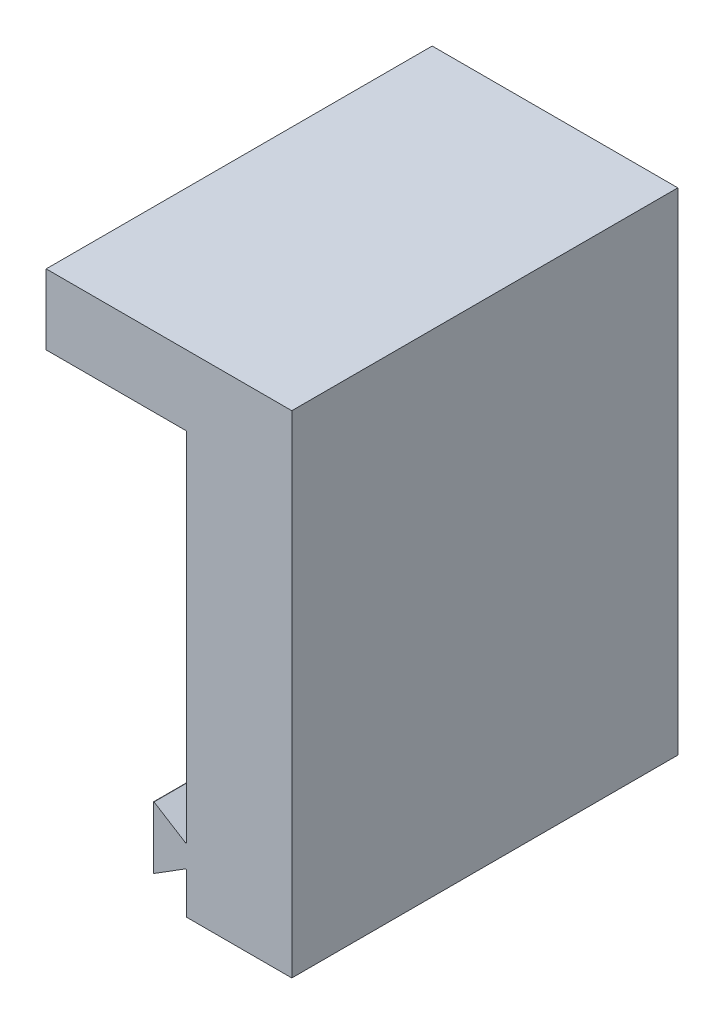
ISO-10303-21;
HEADER;
FILE_DESCRIPTION(('STEP AP214'),'2;1');
FILE_NAME('part.step','',(''),(''),'','','');
FILE_SCHEMA(('AUTOMOTIVE_DESIGN { 1 0 10303 214 1 1 1 1 }'));
ENDSEC;
DATA;
#1=APPLICATION_CONTEXT('core data for automotive mechanical design processes');
#2=APPLICATION_PROTOCOL_DEFINITION('international standard','automotive_design',2000,#1);
#3=PRODUCT_CONTEXT('',#1,'mechanical');
#4=PRODUCT('Part','Part','',(#3));
#5=PRODUCT_RELATED_PRODUCT_CATEGORY('part','',(#4));
#6=PRODUCT_DEFINITION_FORMATION('','',#4);
#7=PRODUCT_DEFINITION_CONTEXT('part definition',#1,'design');
#8=PRODUCT_DEFINITION('design','',#6,#7);
#9=PRODUCT_DEFINITION_SHAPE('','',#8);
#10=(LENGTH_UNIT() NAMED_UNIT(*) SI_UNIT(.MILLI.,.METRE.));
#11=(NAMED_UNIT(*) PLANE_ANGLE_UNIT() SI_UNIT($,.RADIAN.));
#12=(NAMED_UNIT(*) SI_UNIT($,.STERADIAN.) SOLID_ANGLE_UNIT());
#13=UNCERTAINTY_MEASURE_WITH_UNIT(LENGTH_MEASURE(1.E-05),#10,'distance_accuracy_value','');
#14=(GEOMETRIC_REPRESENTATION_CONTEXT(3) GLOBAL_UNCERTAINTY_ASSIGNED_CONTEXT((#13)) GLOBAL_UNIT_ASSIGNED_CONTEXT((#10,
#11,#12)) REPRESENTATION_CONTEXT('',''));
#15=CARTESIAN_POINT('',(0.,0.,0.));
#16=DIRECTION('',(0.,0.,1.));
#17=DIRECTION('',(1.,0.,0.));
#18=AXIS2_PLACEMENT_3D('',#15,#16,#17);
#19=CARTESIAN_POINT('',(0.,-108.241171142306,110.));
#20=DIRECTION('',(0.,1.,0.));
#21=DIRECTION('',(0.,0.,1.));
#22=AXIS2_PLACEMENT_3D('',#19,#20,#21);
#23=PLANE('',#22);
#24=DIRECTION('',(-1.,0.,0.));
#25=VECTOR('',#24,1.);
#26=CARTESIAN_POINT('',(0.,-108.241171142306,35.));
#27=LINE('',#26,#25);
#28=CARTESIAN_POINT('',(0.,-108.241171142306,35.));
#29=VERTEX_POINT('',#28);
#30=CARTESIAN_POINT('',(-0.31795155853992,-108.241171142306,35.));
#31=VERTEX_POINT('',#30);
#32=EDGE_CURVE('E261',#29,#31,#27,.T.);
#33=ORIENTED_EDGE('',*,*,#32,.F.);
#34=DIRECTION('',(0.,0.,-1.));
#35=VECTOR('',#34,1.);
#36=CARTESIAN_POINT('',(0.,-108.241171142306,110.));
#37=LINE('',#36,#35);
#38=CARTESIAN_POINT('',(0.,-108.241171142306,75.));
#39=VERTEX_POINT('',#38);
#40=EDGE_CURVE('E255',#39,#29,#37,.T.);
#41=ORIENTED_EDGE('',*,*,#40,.F.);
#42=DIRECTION('',(1.,0.,0.));
#43=VECTOR('',#42,1.);
#44=CARTESIAN_POINT('',(0.,-108.241171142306,75.));
#45=LINE('',#44,#43);
#46=CARTESIAN_POINT('',(-0.31795155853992,-108.241171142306,75.));
#47=VERTEX_POINT('',#46);
#48=EDGE_CURVE('E236',#47,#39,#45,.T.);
#49=ORIENTED_EDGE('',*,*,#48,.F.);
#50=DIRECTION('',(0.,0.,-1.));
#51=VECTOR('',#50,1.);
#52=CARTESIAN_POINT('',(-0.31795155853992,-108.241171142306,110.));
#53=LINE('',#52,#51);
#54=EDGE_CURVE('E443',#47,#31,#53,.T.);
#55=ORIENTED_EDGE('',*,*,#54,.T.);
#56=EDGE_LOOP('',(#33,#41,#49,#55));
#57=FACE_BOUND('',#56,.T.);
#58=ADVANCED_FACE('F40',(#57),#23,.F.);
#59=DIRECTION('',(1.,0.,0.));
#60=VECTOR('',#59,1.);
#61=CARTESIAN_POINT('',(0.,-108.241171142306,25.));
#62=LINE('',#61,#60);
#63=CARTESIAN_POINT('',(-0.31795155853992,-108.241171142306,25.));
#64=VERTEX_POINT('',#63);
#65=CARTESIAN_POINT('',(0.,-108.241171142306,25.));
#66=VERTEX_POINT('',#65);
#67=EDGE_CURVE('E357',#64,#66,#62,.T.);
#68=ORIENTED_EDGE('',*,*,#67,.F.);
#69=CARTESIAN_POINT('',(-0.31795155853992,-108.241171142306,0.));
#70=VERTEX_POINT('',#69);
#71=EDGE_CURVE('E415',#64,#70,#53,.T.);
#72=ORIENTED_EDGE('',*,*,#71,.T.);
#73=DIRECTION('',(1.,0.,0.));
#74=VECTOR('',#73,1.);
#75=CARTESIAN_POINT('',(0.,-108.241171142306,0.));
#76=LINE('',#75,#74);
#77=CARTESIAN_POINT('',(0.,-108.241171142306,0.));
#78=VERTEX_POINT('',#77);
#79=EDGE_CURVE('E394',#70,#78,#76,.T.);
#80=ORIENTED_EDGE('',*,*,#79,.T.);
#81=EDGE_CURVE('E263',#66,#78,#37,.T.);
#82=ORIENTED_EDGE('',*,*,#81,.F.);
#83=EDGE_LOOP('',(#68,#72,#80,#82));
#84=FACE_BOUND('',#83,.T.);
#85=ADVANCED_FACE('F574',(#84),#23,.F.);
#86=DIRECTION('',(-1.,0.,0.));
#87=VECTOR('',#86,1.);
#88=CARTESIAN_POINT('',(0.,-108.241171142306,85.));
#89=LINE('',#88,#87);
#90=CARTESIAN_POINT('',(0.,-108.241171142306,85.));
#91=VERTEX_POINT('',#90);
#92=CARTESIAN_POINT('',(-0.31795155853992,-108.241171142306,85.));
#93=VERTEX_POINT('',#92);
#94=EDGE_CURVE('E343',#91,#93,#89,.T.);
#95=ORIENTED_EDGE('',*,*,#94,.F.);
#96=CARTESIAN_POINT('',(0.,-108.241171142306,110.));
#97=VERTEX_POINT('',#96);
#98=EDGE_CURVE('E262',#97,#91,#37,.T.);
#99=ORIENTED_EDGE('',*,*,#98,.F.);
#100=DIRECTION('',(1.,0.,0.));
#101=VECTOR('',#100,1.);
#102=CARTESIAN_POINT('',(0.,-108.241171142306,110.));
#103=LINE('',#102,#101);
#104=CARTESIAN_POINT('',(-0.31795155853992,-108.241171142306,110.));
#105=VERTEX_POINT('',#104);
#106=EDGE_CURVE('E395',#105,#97,#103,.T.);
#107=ORIENTED_EDGE('',*,*,#106,.F.);
#108=EDGE_CURVE('E439',#105,#93,#53,.T.);
#109=ORIENTED_EDGE('',*,*,#108,.T.);
#110=EDGE_LOOP('',(#95,#99,#107,#109));
#111=FACE_BOUND('',#110,.T.);
#112=ADVANCED_FACE('F485',(#111),#23,.F.);
#113=CARTESIAN_POINT('',(0.,-101.758828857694,110.));
#114=DIRECTION('',(0.,-1.,0.));
#115=DIRECTION('',(0.,0.,-1.));
#116=AXIS2_PLACEMENT_3D('',#113,#114,#115);
#117=PLANE('',#116);
#118=DIRECTION('',(1.,0.,0.));
#119=VECTOR('',#118,1.);
#120=CARTESIAN_POINT('',(0.,-101.758828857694,35.));
#121=LINE('',#120,#119);
#122=CARTESIAN_POINT('',(-0.317951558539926,-101.758828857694,35.));
#123=VERTEX_POINT('',#122);
#124=CARTESIAN_POINT('',(0.,-101.758828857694,35.));
#125=VERTEX_POINT('',#124);
#126=EDGE_CURVE('E363',#123,#125,#121,.T.);
#127=ORIENTED_EDGE('',*,*,#126,.F.);
#128=DIRECTION('',(0.,0.,-1.));
#129=VECTOR('',#128,1.);
#130=CARTESIAN_POINT('',(-0.317951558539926,-101.758828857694,110.));
#131=LINE('',#130,#129);
#132=CARTESIAN_POINT('',(-0.317951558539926,-101.758828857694,75.));
#133=VERTEX_POINT('',#132);
#134=EDGE_CURVE('E448',#133,#123,#131,.T.);
#135=ORIENTED_EDGE('',*,*,#134,.F.);
#136=DIRECTION('',(-1.,0.,0.));
#137=VECTOR('',#136,1.);
#138=CARTESIAN_POINT('',(0.,-101.758828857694,75.));
#139=LINE('',#138,#137);
#140=CARTESIAN_POINT('',(0.,-101.758828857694,75.));
#141=VERTEX_POINT('',#140);
#142=EDGE_CURVE('E324',#141,#133,#139,.T.);
#143=ORIENTED_EDGE('',*,*,#142,.F.);
#144=DIRECTION('',(0.,0.,-1.));
#145=VECTOR('',#144,1.);
#146=CARTESIAN_POINT('',(0.,-101.758828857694,110.));
#147=LINE('',#146,#145);
#148=EDGE_CURVE('E257',#141,#125,#147,.T.);
#149=ORIENTED_EDGE('',*,*,#148,.T.);
#150=EDGE_LOOP('',(#127,#135,#143,#149));
#151=FACE_BOUND('',#150,.T.);
#152=ADVANCED_FACE('F524',(#151),#117,.F.);
#153=DIRECTION('',(-1.,0.,0.));
#154=VECTOR('',#153,1.);
#155=CARTESIAN_POINT('',(0.,-101.758828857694,25.));
#156=LINE('',#155,#154);
#157=CARTESIAN_POINT('',(0.,-101.758828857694,25.));
#158=VERTEX_POINT('',#157);
#159=CARTESIAN_POINT('',(-0.317951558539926,-101.758828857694,25.));
#160=VERTEX_POINT('',#159);
#161=EDGE_CURVE('E350',#158,#160,#156,.T.);
#162=ORIENTED_EDGE('',*,*,#161,.F.);
#163=CARTESIAN_POINT('',(0.,-101.758828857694,0.));
#164=VERTEX_POINT('',#163);
#165=EDGE_CURVE('E447',#158,#164,#147,.T.);
#166=ORIENTED_EDGE('',*,*,#165,.T.);
#167=DIRECTION('',(-1.,0.,0.));
#168=VECTOR('',#167,1.);
#169=CARTESIAN_POINT('',(0.,-101.758828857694,0.));
#170=LINE('',#169,#168);
#171=CARTESIAN_POINT('',(-0.317951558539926,-101.758828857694,0.));
#172=VERTEX_POINT('',#171);
#173=EDGE_CURVE('E428',#164,#172,#170,.T.);
#174=ORIENTED_EDGE('',*,*,#173,.T.);
#175=EDGE_CURVE('E442',#160,#172,#131,.T.);
#176=ORIENTED_EDGE('',*,*,#175,.F.);
#177=EDGE_LOOP('',(#162,#166,#174,#176));
#178=FACE_BOUND('',#177,.T.);
#179=ADVANCED_FACE('F529',(#178),#117,.F.);
#180=DIRECTION('',(1.,0.,0.));
#181=VECTOR('',#180,1.);
#182=CARTESIAN_POINT('',(0.,-101.758828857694,85.));
#183=LINE('',#182,#181);
#184=CARTESIAN_POINT('',(-0.317951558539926,-101.758828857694,85.));
#185=VERTEX_POINT('',#184);
#186=CARTESIAN_POINT('',(0.,-101.758828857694,85.));
#187=VERTEX_POINT('',#186);
#188=EDGE_CURVE('E336',#185,#187,#183,.T.);
#189=ORIENTED_EDGE('',*,*,#188,.F.);
#190=CARTESIAN_POINT('',(-0.317951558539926,-101.758828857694,110.));
#191=VERTEX_POINT('',#190);
#192=EDGE_CURVE('E444',#191,#185,#131,.T.);
#193=ORIENTED_EDGE('',*,*,#192,.F.);
#194=DIRECTION('',(-1.,0.,0.));
#195=VECTOR('',#194,1.);
#196=CARTESIAN_POINT('',(0.,-101.758828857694,110.));
#197=LINE('',#196,#195);
#198=CARTESIAN_POINT('',(0.,-101.758828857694,110.));
#199=VERTEX_POINT('',#198);
#200=EDGE_CURVE('E407',#199,#191,#197,.T.);
#201=ORIENTED_EDGE('',*,*,#200,.F.);
#202=EDGE_CURVE('E449',#199,#187,#147,.T.);
#203=ORIENTED_EDGE('',*,*,#202,.T.);
#204=EDGE_LOOP('',(#189,#193,#201,#203));
#205=FACE_BOUND('',#204,.T.);
#206=ADVANCED_FACE('F509',(#205),#117,.F.);
#207=CARTESIAN_POINT('',(-45.8194001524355,-73.3263681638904,110.));
#208=DIRECTION('',(-0.52991926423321,-0.848048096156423,0.));
#209=DIRECTION('',(0.848048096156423,-0.52991926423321,0.));
#210=AXIS2_PLACEMENT_3D('',#207,#208,#209);
#211=PLANE('',#210);
#212=DIRECTION('',(0.848048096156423,-0.52991926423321,0.));
#213=VECTOR('',#212,1.);
#214=CARTESIAN_POINT('',(-45.8194001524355,-73.3263681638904,35.));
#215=LINE('',#214,#213);
#216=CARTESIAN_POINT('',(-9.24909888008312,-96.1780286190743,35.));
#217=VERTEX_POINT('',#216);
#218=EDGE_CURVE('E307',#217,#123,#215,.T.);
#219=ORIENTED_EDGE('',*,*,#218,.F.);
#220=DIRECTION('',(0.,0.,-1.));
#221=VECTOR('',#220,1.);
#222=CARTESIAN_POINT('',(-9.24909888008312,-96.1780286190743,110.));
#223=LINE('',#222,#221);
#224=CARTESIAN_POINT('',(-9.24909888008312,-96.1780286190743,75.));
#225=VERTEX_POINT('',#224);
#226=EDGE_CURVE('E48',#217,#225,#223,.F.);
#227=ORIENTED_EDGE('',*,*,#226,.T.);
#228=DIRECTION('',(-0.848048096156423,0.52991926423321,0.));
#229=VECTOR('',#228,1.);
#230=CARTESIAN_POINT('',(-45.8194001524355,-73.3263681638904,75.));
#231=LINE('',#230,#229);
#232=EDGE_CURVE('E56',#133,#225,#231,.T.);
#233=ORIENTED_EDGE('',*,*,#232,.F.);
#234=ORIENTED_EDGE('',*,*,#134,.T.);
#235=EDGE_LOOP('',(#219,#227,#233,#234));
#236=FACE_BOUND('',#235,.T.);
#237=ADVANCED_FACE('F304',(#236),#211,.F.);
#238=DIRECTION('',(-0.848048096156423,0.52991926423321,0.));
#239=VECTOR('',#238,1.);
#240=CARTESIAN_POINT('',(-45.8194001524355,-73.3263681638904,25.));
#241=LINE('',#240,#239);
#242=CARTESIAN_POINT('',(-9.24909888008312,-96.1780286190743,25.));
#243=VERTEX_POINT('',#242);
#244=EDGE_CURVE('E64',#160,#243,#241,.T.);
#245=ORIENTED_EDGE('',*,*,#244,.F.);
#246=ORIENTED_EDGE('',*,*,#175,.T.);
#247=DIRECTION('',(-0.848048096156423,0.52991926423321,0.));
#248=VECTOR('',#247,1.);
#249=CARTESIAN_POINT('',(-45.8194001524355,-73.3263681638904,0.));
#250=LINE('',#249,#248);
#251=CARTESIAN_POINT('',(-9.24909888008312,-96.1780286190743,0.));
#252=VERTEX_POINT('',#251);
#253=EDGE_CURVE('E431',#172,#252,#250,.T.);
#254=ORIENTED_EDGE('',*,*,#253,.T.);
#255=EDGE_CURVE('E11',#252,#243,#223,.F.);
#256=ORIENTED_EDGE('',*,*,#255,.T.);
#257=EDGE_LOOP('',(#245,#246,#254,#256));
#258=FACE_BOUND('',#257,.T.);
#259=ADVANCED_FACE('F527',(#258),#211,.F.);
#260=DIRECTION('',(0.848048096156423,-0.52991926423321,0.));
#261=VECTOR('',#260,1.);
#262=CARTESIAN_POINT('',(-45.8194001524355,-73.3263681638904,85.));
#263=LINE('',#262,#261);
#264=CARTESIAN_POINT('',(-9.24909888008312,-96.1780286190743,85.));
#265=VERTEX_POINT('',#264);
#266=EDGE_CURVE('E334',#265,#185,#263,.T.);
#267=ORIENTED_EDGE('',*,*,#266,.F.);
#268=CARTESIAN_POINT('',(-9.24909888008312,-96.1780286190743,110.));
#269=VERTEX_POINT('',#268);
#270=EDGE_CURVE('E49',#265,#269,#223,.F.);
#271=ORIENTED_EDGE('',*,*,#270,.T.);
#272=DIRECTION('',(-0.848048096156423,0.52991926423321,0.));
#273=VECTOR('',#272,1.);
#274=CARTESIAN_POINT('',(-45.8194001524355,-73.3263681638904,110.));
#275=LINE('',#274,#273);
#276=EDGE_CURVE('E409',#191,#269,#275,.T.);
#277=ORIENTED_EDGE('',*,*,#276,.F.);
#278=ORIENTED_EDGE('',*,*,#192,.T.);
#279=EDGE_LOOP('',(#267,#271,#277,#278));
#280=FACE_BOUND('',#279,.T.);
#281=ADVANCED_FACE('F505',(#280),#211,.F.);
#282=CARTESIAN_POINT('',(-9.40209080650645,0.,110.));
#283=DIRECTION('',(1.,0.,0.));
#284=DIRECTION('',(0.,0.,-1.));
#285=AXIS2_PLACEMENT_3D('',#282,#283,#284);
#286=PLANE('',#285);
#287=DIRECTION('',(0.,1.,0.));
#288=VECTOR('',#287,1.);
#289=CARTESIAN_POINT('',(-9.40209080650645,0.,35.));
#290=LINE('',#289,#288);
#291=CARTESIAN_POINT('',(-9.40209080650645,-113.73716657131,35.));
#292=VERTEX_POINT('',#291);
#293=CARTESIAN_POINT('',(-9.40209080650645,-96.26283342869,35.));
#294=VERTEX_POINT('',#293);
#295=EDGE_CURVE('E360',#292,#294,#290,.T.);
#296=ORIENTED_EDGE('',*,*,#295,.F.);
#297=DIRECTION('',(0.,0.,-1.));
#298=VECTOR('',#297,1.);
#299=CARTESIAN_POINT('',(-9.40209080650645,-113.73716657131,110.));
#300=LINE('',#299,#298);
#301=CARTESIAN_POINT('',(-9.40209080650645,-113.73716657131,75.));
#302=VERTEX_POINT('',#301);
#303=EDGE_CURVE('E289',#292,#302,#300,.F.);
#304=ORIENTED_EDGE('',*,*,#303,.T.);
#305=DIRECTION('',(0.,-1.,0.));
#306=VECTOR('',#305,1.);
#307=CARTESIAN_POINT('',(-9.40209080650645,0.,75.));
#308=LINE('',#307,#306);
#309=CARTESIAN_POINT('',(-9.40209080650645,-96.26283342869,75.));
#310=VERTEX_POINT('',#309);
#311=EDGE_CURVE('E315',#310,#302,#308,.T.);
#312=ORIENTED_EDGE('',*,*,#311,.F.);
#313=DIRECTION('',(0.,0.,-1.));
#314=VECTOR('',#313,1.);
#315=CARTESIAN_POINT('',(-9.40209080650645,-96.26283342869,110.));
#316=LINE('',#315,#314);
#317=EDGE_CURVE('E284',#310,#294,#316,.T.);
#318=ORIENTED_EDGE('',*,*,#317,.T.);
#319=EDGE_LOOP('',(#296,#304,#312,#318));
#320=FACE_BOUND('',#319,.T.);
#321=ADVANCED_FACE('F563',(#320),#286,.F.);
#322=DIRECTION('',(0.,-1.,0.));
#323=VECTOR('',#322,1.);
#324=CARTESIAN_POINT('',(-9.40209080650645,0.,25.));
#325=LINE('',#324,#323);
#326=CARTESIAN_POINT('',(-9.40209080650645,-96.26283342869,25.));
#327=VERTEX_POINT('',#326);
#328=CARTESIAN_POINT('',(-9.40209080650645,-113.73716657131,25.));
#329=VERTEX_POINT('',#328);
#330=EDGE_CURVE('E347',#327,#329,#325,.T.);
#331=ORIENTED_EDGE('',*,*,#330,.F.);
#332=CARTESIAN_POINT('',(-9.40209080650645,-96.26283342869,0.));
#333=VERTEX_POINT('',#332);
#334=EDGE_CURVE('E279',#327,#333,#316,.T.);
#335=ORIENTED_EDGE('',*,*,#334,.T.);
#336=DIRECTION('',(0.,-1.,0.));
#337=VECTOR('',#336,1.);
#338=CARTESIAN_POINT('',(-9.40209080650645,0.,0.));
#339=LINE('',#338,#337);
#340=CARTESIAN_POINT('',(-9.40209080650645,-113.73716657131,0.));
#341=VERTEX_POINT('',#340);
#342=EDGE_CURVE('E434',#333,#341,#339,.T.);
#343=ORIENTED_EDGE('',*,*,#342,.T.);
#344=EDGE_CURVE('E285',#341,#329,#300,.F.);
#345=ORIENTED_EDGE('',*,*,#344,.T.);
#346=EDGE_LOOP('',(#331,#335,#343,#345));
#347=FACE_BOUND('',#346,.T.);
#348=ADVANCED_FACE('F538',(#347),#286,.F.);
#349=DIRECTION('',(0.,1.,0.));
#350=VECTOR('',#349,1.);
#351=CARTESIAN_POINT('',(-9.40209080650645,0.,85.));
#352=LINE('',#351,#350);
#353=CARTESIAN_POINT('',(-9.40209080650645,-113.73716657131,85.));
#354=VERTEX_POINT('',#353);
#355=CARTESIAN_POINT('',(-9.40209080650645,-96.26283342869,85.));
#356=VERTEX_POINT('',#355);
#357=EDGE_CURVE('E332',#354,#356,#352,.T.);
#358=ORIENTED_EDGE('',*,*,#357,.F.);
#359=CARTESIAN_POINT('',(-9.40209080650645,-113.73716657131,110.));
#360=VERTEX_POINT('',#359);
#361=EDGE_CURVE('E283',#354,#360,#300,.F.);
#362=ORIENTED_EDGE('',*,*,#361,.T.);
#363=DIRECTION('',(0.,-1.,0.));
#364=VECTOR('',#363,1.);
#365=CARTESIAN_POINT('',(-9.40209080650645,0.,110.));
#366=LINE('',#365,#364);
#367=CARTESIAN_POINT('',(-9.40209080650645,-96.26283342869,110.));
#368=VERTEX_POINT('',#367);
#369=EDGE_CURVE('E411',#368,#360,#366,.T.);
#370=ORIENTED_EDGE('',*,*,#369,.F.);
#371=EDGE_CURVE('E280',#368,#356,#316,.T.);
#372=ORIENTED_EDGE('',*,*,#371,.T.);
#373=EDGE_LOOP('',(#358,#362,#370,#372));
#374=FACE_BOUND('',#373,.T.);
#375=ADVANCED_FACE('F498',(#374),#286,.F.);
#376=CARTESIAN_POINT('',(48.5539747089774,-77.7026022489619,110.));
#377=DIRECTION('',(-0.529919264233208,0.848048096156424,0.));
#378=DIRECTION('',(-0.848048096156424,-0.529919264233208,0.));
#379=AXIS2_PLACEMENT_3D('',#376,#377,#378);
#380=PLANE('',#379);
#381=DIRECTION('',(-0.848048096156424,-0.529919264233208,0.));
#382=VECTOR('',#381,1.);
#383=CARTESIAN_POINT('',(48.5539747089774,-77.7026022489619,35.));
#384=LINE('',#383,#382);
#385=CARTESIAN_POINT('',(-9.24909888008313,-113.821971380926,35.));
#386=VERTEX_POINT('',#385);
#387=EDGE_CURVE('E368',#31,#386,#384,.T.);
#388=ORIENTED_EDGE('',*,*,#387,.F.);
#389=ORIENTED_EDGE('',*,*,#54,.F.);
#390=DIRECTION('',(0.848048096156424,0.529919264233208,0.));
#391=VECTOR('',#390,1.);
#392=CARTESIAN_POINT('',(48.5539747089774,-77.7026022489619,75.));
#393=LINE('',#392,#391);
#394=CARTESIAN_POINT('',(-9.24909888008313,-113.821971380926,75.));
#395=VERTEX_POINT('',#394);
#396=EDGE_CURVE('E242',#395,#47,#393,.T.);
#397=ORIENTED_EDGE('',*,*,#396,.F.);
#398=DIRECTION('',(0.,0.,-1.));
#399=VECTOR('',#398,1.);
#400=CARTESIAN_POINT('',(-9.24909888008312,-113.821971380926,110.));
#401=LINE('',#400,#399);
#402=EDGE_CURVE('E275',#395,#386,#401,.T.);
#403=ORIENTED_EDGE('',*,*,#402,.T.);
#404=EDGE_LOOP('',(#388,#389,#397,#403));
#405=FACE_BOUND('',#404,.T.);
#406=ADVANCED_FACE('F552',(#405),#380,.F.);
#407=DIRECTION('',(0.848048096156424,0.529919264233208,0.));
#408=VECTOR('',#407,1.);
#409=CARTESIAN_POINT('',(48.5539747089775,-77.7026022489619,25.));
#410=LINE('',#409,#408);
#411=CARTESIAN_POINT('',(-9.24909888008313,-113.821971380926,25.));
#412=VERTEX_POINT('',#411);
#413=EDGE_CURVE('E355',#412,#64,#410,.T.);
#414=ORIENTED_EDGE('',*,*,#413,.F.);
#415=CARTESIAN_POINT('',(-9.24909888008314,-113.821971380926,0.));
#416=VERTEX_POINT('',#415);
#417=EDGE_CURVE('E266',#412,#416,#401,.T.);
#418=ORIENTED_EDGE('',*,*,#417,.T.);
#419=DIRECTION('',(0.848048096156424,0.529919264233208,0.));
#420=VECTOR('',#419,1.);
#421=CARTESIAN_POINT('',(48.5539747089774,-77.7026022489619,0.));
#422=LINE('',#421,#420);
#423=EDGE_CURVE('E399',#416,#70,#422,.T.);
#424=ORIENTED_EDGE('',*,*,#423,.T.);
#425=ORIENTED_EDGE('',*,*,#71,.F.);
#426=EDGE_LOOP('',(#414,#418,#424,#425));
#427=FACE_BOUND('',#426,.T.);
#428=ADVANCED_FACE('F548',(#427),#380,.F.);
#429=DIRECTION('',(-0.848048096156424,-0.529919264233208,0.));
#430=VECTOR('',#429,1.);
#431=CARTESIAN_POINT('',(48.5539747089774,-77.7026022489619,85.));
#432=LINE('',#431,#430);
#433=CARTESIAN_POINT('',(-9.24909888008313,-113.821971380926,85.));
#434=VERTEX_POINT('',#433);
#435=EDGE_CURVE('E341',#93,#434,#432,.T.);
#436=ORIENTED_EDGE('',*,*,#435,.F.);
#437=ORIENTED_EDGE('',*,*,#108,.F.);
#438=DIRECTION('',(0.848048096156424,0.529919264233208,0.));
#439=VECTOR('',#438,1.);
#440=CARTESIAN_POINT('',(48.5539747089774,-77.7026022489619,110.));
#441=LINE('',#440,#439);
#442=CARTESIAN_POINT('',(-9.24909888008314,-113.821971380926,110.));
#443=VERTEX_POINT('',#442);
#444=EDGE_CURVE('E413',#443,#105,#441,.T.);
#445=ORIENTED_EDGE('',*,*,#444,.F.);
#446=EDGE_CURVE('E271',#443,#434,#401,.T.);
#447=ORIENTED_EDGE('',*,*,#446,.T.);
#448=EDGE_LOOP('',(#436,#437,#445,#447));
#449=FACE_BOUND('',#448,.T.);
#450=ADVANCED_FACE('F491',(#449),#380,.F.);
#451=CARTESIAN_POINT('',(-9.30209080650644,-113.73716657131,110.));
#452=DIRECTION('',(0.,0.,-1.));
#453=DIRECTION('',(-1.,0.,0.));
#454=AXIS2_PLACEMENT_3D('',#451,#452,#453);
#455=CYLINDRICAL_SURFACE('',#454,0.1);
#456=ORIENTED_EDGE('',*,*,#303,.F.);
#457=CARTESIAN_POINT('',(-9.30209080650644,-113.73716657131,35.));
#458=DIRECTION('',(0.,0.,-1.));
#459=DIRECTION('',(-1.,0.,0.));
#460=AXIS2_PLACEMENT_3D('',#457,#458,#459);
#461=CIRCLE('',#460,0.1);
#462=EDGE_CURVE('E365',#292,#386,#461,.F.);
#463=ORIENTED_EDGE('',*,*,#462,.T.);
#464=ORIENTED_EDGE('',*,*,#402,.F.);
#465=CARTESIAN_POINT('',(-9.30209080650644,-113.73716657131,75.));
#466=DIRECTION('',(0.,0.,1.));
#467=DIRECTION('',(1.,0.,0.));
#468=AXIS2_PLACEMENT_3D('',#465,#466,#467);
#469=CIRCLE('',#468,0.1);
#470=EDGE_CURVE('E326',#395,#302,#469,.F.);
#471=ORIENTED_EDGE('',*,*,#470,.T.);
#472=EDGE_LOOP('',(#456,#463,#464,#471));
#473=FACE_BOUND('',#472,.T.);
#474=ADVANCED_FACE('F560',(#473),#455,.T.);
#475=ORIENTED_EDGE('',*,*,#417,.F.);
#476=CARTESIAN_POINT('',(-9.30209080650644,-113.73716657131,25.));
#477=DIRECTION('',(0.,0.,1.));
#478=DIRECTION('',(1.,0.,0.));
#479=AXIS2_PLACEMENT_3D('',#476,#477,#478);
#480=CIRCLE('',#479,0.1);
#481=EDGE_CURVE('E352',#412,#329,#480,.F.);
#482=ORIENTED_EDGE('',*,*,#481,.T.);
#483=ORIENTED_EDGE('',*,*,#344,.F.);
#484=CARTESIAN_POINT('',(-9.30209080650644,-113.73716657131,0.));
#485=DIRECTION('',(0.,0.,1.));
#486=DIRECTION('',(1.,0.,0.));
#487=AXIS2_PLACEMENT_3D('',#484,#485,#486);
#488=CIRCLE('',#487,0.1);
#489=EDGE_CURVE('E277',#416,#341,#488,.F.);
#490=ORIENTED_EDGE('',*,*,#489,.F.);
#491=EDGE_LOOP('',(#475,#482,#483,#490));
#492=FACE_BOUND('',#491,.T.);
#493=ADVANCED_FACE('F543',(#492),#455,.T.);
#494=ORIENTED_EDGE('',*,*,#361,.F.);
#495=CARTESIAN_POINT('',(-9.30209080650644,-113.73716657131,85.));
#496=DIRECTION('',(0.,0.,-1.));
#497=DIRECTION('',(-1.,0.,0.));
#498=AXIS2_PLACEMENT_3D('',#495,#496,#497);
#499=CIRCLE('',#498,0.1);
#500=EDGE_CURVE('E338',#354,#434,#499,.F.);
#501=ORIENTED_EDGE('',*,*,#500,.T.);
#502=ORIENTED_EDGE('',*,*,#446,.F.);
#503=CARTESIAN_POINT('',(-9.30209080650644,-113.73716657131,110.));
#504=DIRECTION('',(0.,0.,1.));
#505=DIRECTION('',(1.,0.,0.));
#506=AXIS2_PLACEMENT_3D('',#503,#504,#505);
#507=CIRCLE('',#506,0.1);
#508=EDGE_CURVE('E290',#360,#443,#507,.T.);
#509=ORIENTED_EDGE('',*,*,#508,.F.);
#510=EDGE_LOOP('',(#494,#501,#502,#509));
#511=FACE_BOUND('',#510,.T.);
#512=ADVANCED_FACE('F495',(#511),#455,.T.);
#513=CARTESIAN_POINT('',(-9.30209080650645,-96.26283342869,110.));
#514=DIRECTION('',(0.,0.,-1.));
#515=DIRECTION('',(-1.,0.,0.));
#516=AXIS2_PLACEMENT_3D('',#513,#514,#515);
#517=CYLINDRICAL_SURFACE('',#516,0.1);
#518=ORIENTED_EDGE('',*,*,#226,.F.);
#519=CARTESIAN_POINT('',(-9.30209080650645,-96.26283342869,35.));
#520=DIRECTION('',(0.,0.,-1.));
#521=DIRECTION('',(-1.,0.,0.));
#522=AXIS2_PLACEMENT_3D('',#519,#520,#521);
#523=CIRCLE('',#522,0.1);
#524=EDGE_CURVE('E311',#217,#294,#523,.F.);
#525=ORIENTED_EDGE('',*,*,#524,.T.);
#526=ORIENTED_EDGE('',*,*,#317,.F.);
#527=CARTESIAN_POINT('',(-9.30209080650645,-96.26283342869,75.));
#528=DIRECTION('',(0.,0.,1.));
#529=DIRECTION('',(1.,0.,0.));
#530=AXIS2_PLACEMENT_3D('',#527,#528,#529);
#531=CIRCLE('',#530,0.1);
#532=EDGE_CURVE('E313',#310,#225,#531,.F.);
#533=ORIENTED_EDGE('',*,*,#532,.T.);
#534=EDGE_LOOP('',(#518,#525,#526,#533));
#535=FACE_BOUND('',#534,.T.);
#536=ADVANCED_FACE('F42',(#535),#517,.T.);
#537=ORIENTED_EDGE('',*,*,#334,.F.);
#538=CARTESIAN_POINT('',(-9.30209080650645,-96.26283342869,25.));
#539=DIRECTION('',(0.,0.,1.));
#540=DIRECTION('',(1.,0.,0.));
#541=AXIS2_PLACEMENT_3D('',#538,#539,#540);
#542=CIRCLE('',#541,0.1);
#543=EDGE_CURVE('E345',#327,#243,#542,.F.);
#544=ORIENTED_EDGE('',*,*,#543,.T.);
#545=ORIENTED_EDGE('',*,*,#255,.F.);
#546=CARTESIAN_POINT('',(-9.30209080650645,-96.26283342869,0.));
#547=DIRECTION('',(0.,0.,1.));
#548=DIRECTION('',(1.,0.,0.));
#549=AXIS2_PLACEMENT_3D('',#546,#547,#548);
#550=CIRCLE('',#549,0.1);
#551=EDGE_CURVE('E274',#333,#252,#550,.F.);
#552=ORIENTED_EDGE('',*,*,#551,.F.);
#553=EDGE_LOOP('',(#537,#544,#545,#552));
#554=FACE_BOUND('',#553,.T.);
#555=ADVANCED_FACE('F534',(#554),#517,.T.);
#556=ORIENTED_EDGE('',*,*,#270,.F.);
#557=CARTESIAN_POINT('',(-9.30209080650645,-96.26283342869,85.));
#558=DIRECTION('',(0.,0.,-1.));
#559=DIRECTION('',(-1.,0.,0.));
#560=AXIS2_PLACEMENT_3D('',#557,#558,#559);
#561=CIRCLE('',#560,0.1);
#562=EDGE_CURVE('E247',#265,#356,#561,.F.);
#563=ORIENTED_EDGE('',*,*,#562,.T.);
#564=ORIENTED_EDGE('',*,*,#371,.F.);
#565=CARTESIAN_POINT('',(-9.30209080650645,-96.26283342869,110.));
#566=DIRECTION('',(0.,0.,1.));
#567=DIRECTION('',(1.,0.,0.));
#568=AXIS2_PLACEMENT_3D('',#565,#566,#567);
#569=CIRCLE('',#568,0.1);
#570=EDGE_CURVE('E288',#269,#368,#569,.T.);
#571=ORIENTED_EDGE('',*,*,#570,.F.);
#572=EDGE_LOOP('',(#556,#563,#564,#571));
#573=FACE_BOUND('',#572,.T.);
#574=ADVANCED_FACE('F503',(#573),#517,.T.);
#575=CARTESIAN_POINT('',(0.,-120.,110.));
#576=DIRECTION('',(0.,1.,0.));
#577=DIRECTION('',(0.,0.,1.));
#578=AXIS2_PLACEMENT_3D('',#575,#576,#577);
#579=PLANE('',#578);
#580=DIRECTION('',(1.,0.,0.));
#581=VECTOR('',#580,1.);
#582=CARTESIAN_POINT('',(0.,-120.,0.));
#583=LINE('',#582,#581);
#584=CARTESIAN_POINT('',(0.,-120.,0.));
#585=VERTEX_POINT('',#584);
#586=CARTESIAN_POINT('',(30.,-120.,0.));
#587=VERTEX_POINT('',#586);
#588=EDGE_CURVE('E421',#585,#587,#583,.T.);
#589=ORIENTED_EDGE('',*,*,#588,.T.);
#590=DIRECTION('',(0.,0.,-1.));
#591=VECTOR('',#590,1.);
#592=CARTESIAN_POINT('',(30.,-120.,110.));
#593=LINE('',#592,#591);
#594=CARTESIAN_POINT('',(30.,-120.,110.));
#595=VERTEX_POINT('',#594);
#596=EDGE_CURVE('E453',#595,#587,#593,.T.);
#597=ORIENTED_EDGE('',*,*,#596,.F.);
#598=DIRECTION('',(1.,0.,0.));
#599=VECTOR('',#598,1.);
#600=CARTESIAN_POINT('',(0.,-120.,110.));
#601=LINE('',#600,#599);
#602=CARTESIAN_POINT('',(0.,-120.,110.));
#603=VERTEX_POINT('',#602);
#604=EDGE_CURVE('E401',#603,#595,#601,.T.);
#605=ORIENTED_EDGE('',*,*,#604,.F.);
#606=DIRECTION('',(0.,0.,-1.));
#607=VECTOR('',#606,1.);
#608=CARTESIAN_POINT('',(0.,-120.,110.));
#609=LINE('',#608,#607);
#610=EDGE_CURVE('E267',#603,#585,#609,.T.);
#611=ORIENTED_EDGE('',*,*,#610,.T.);
#612=EDGE_LOOP('',(#589,#597,#605,#611));
#613=FACE_BOUND('',#612,.T.);
#614=ADVANCED_FACE('F459',(#613),#579,.F.);
#615=CARTESIAN_POINT('',(30.,0.,110.));
#616=DIRECTION('',(1.,0.,0.));
#617=DIRECTION('',(0.,1.,0.));
#618=AXIS2_PLACEMENT_3D('',#615,#616,#617);
#619=PLANE('',#618);
#620=DIRECTION('',(0.,-1.,0.));
#621=VECTOR('',#620,1.);
#622=CARTESIAN_POINT('',(30.,0.,0.));
#623=LINE('',#622,#621);
#624=CARTESIAN_POINT('',(30.,20.,0.));
#625=VERTEX_POINT('',#624);
#626=EDGE_CURVE('E425',#625,#587,#623,.T.);
#627=ORIENTED_EDGE('',*,*,#626,.F.);
#628=DIRECTION('',(0.,0.,-1.));
#629=VECTOR('',#628,1.);
#630=CARTESIAN_POINT('',(30.,20.,0.));
#631=LINE('',#630,#629);
#632=CARTESIAN_POINT('',(30.,20.,110.));
#633=VERTEX_POINT('',#632);
#634=EDGE_CURVE('E372',#633,#625,#631,.T.);
#635=ORIENTED_EDGE('',*,*,#634,.F.);
#636=DIRECTION('',(0.,-1.,0.));
#637=VECTOR('',#636,1.);
#638=CARTESIAN_POINT('',(30.,0.,110.));
#639=LINE('',#638,#637);
#640=EDGE_CURVE('E404',#633,#595,#639,.T.);
#641=ORIENTED_EDGE('',*,*,#640,.T.);
#642=ORIENTED_EDGE('',*,*,#596,.T.);
#643=EDGE_LOOP('',(#627,#635,#641,#642));
#644=FACE_BOUND('',#643,.T.);
#645=ADVANCED_FACE('F471',(#644),#619,.T.);
#646=CARTESIAN_POINT('',(0.,0.,110.));
#647=DIRECTION('',(1.,0.,0.));
#648=DIRECTION('',(0.,1.,0.));
#649=AXIS2_PLACEMENT_3D('',#646,#647,#648);
#650=PLANE('',#649);
#651=ORIENTED_EDGE('',*,*,#40,.T.);
#652=DIRECTION('',(0.,1.,0.));
#653=VECTOR('',#652,1.);
#654=CARTESIAN_POINT('',(0.,-140.,35.));
#655=LINE('',#654,#653);
#656=EDGE_CURVE('E316',#29,#125,#655,.T.);
#657=ORIENTED_EDGE('',*,*,#656,.T.);
#658=ORIENTED_EDGE('',*,*,#148,.F.);
#659=DIRECTION('',(0.,1.,0.));
#660=VECTOR('',#659,1.);
#661=CARTESIAN_POINT('',(0.,-140.,75.));
#662=LINE('',#661,#660);
#663=EDGE_CURVE('E239',#39,#141,#662,.T.);
#664=ORIENTED_EDGE('',*,*,#663,.F.);
#665=EDGE_LOOP('',(#651,#657,#658,#664));
#666=FACE_BOUND('',#665,.T.);
#667=DIRECTION('',(0.,0.,-1.));
#668=VECTOR('',#667,1.);
#669=CARTESIAN_POINT('',(0.,0.,110.));
#670=LINE('',#669,#668);
#671=CARTESIAN_POINT('',(0.,0.,110.));
#672=VERTEX_POINT('',#671);
#673=CARTESIAN_POINT('',(0.,0.,0.));
#674=VERTEX_POINT('',#673);
#675=EDGE_CURVE('E452',#672,#674,#670,.T.);
#676=ORIENTED_EDGE('',*,*,#675,.T.);
#677=DIRECTION('',(0.,-1.,0.));
#678=VECTOR('',#677,1.);
#679=CARTESIAN_POINT('',(0.,0.,0.));
#680=LINE('',#679,#678);
#681=EDGE_CURVE('E422',#674,#164,#680,.T.);
#682=ORIENTED_EDGE('',*,*,#681,.T.);
#683=ORIENTED_EDGE('',*,*,#165,.F.);
#684=DIRECTION('',(0.,1.,0.));
#685=VECTOR('',#684,1.);
#686=CARTESIAN_POINT('',(0.,-140.,25.));
#687=LINE('',#686,#685);
#688=EDGE_CURVE('E319',#66,#158,#687,.T.);
#689=ORIENTED_EDGE('',*,*,#688,.F.);
#690=ORIENTED_EDGE('',*,*,#81,.T.);
#691=EDGE_CURVE('E418',#78,#585,#680,.T.);
#692=ORIENTED_EDGE('',*,*,#691,.T.);
#693=ORIENTED_EDGE('',*,*,#610,.F.);
#694=DIRECTION('',(0.,-1.,0.));
#695=VECTOR('',#694,1.);
#696=CARTESIAN_POINT('',(0.,0.,110.));
#697=LINE('',#696,#695);
#698=EDGE_CURVE('E398',#97,#603,#697,.T.);
#699=ORIENTED_EDGE('',*,*,#698,.F.);
#700=ORIENTED_EDGE('',*,*,#98,.T.);
#701=DIRECTION('',(0.,1.,0.));
#702=VECTOR('',#701,1.);
#703=CARTESIAN_POINT('',(0.,-140.,85.));
#704=LINE('',#703,#702);
#705=EDGE_CURVE('E258',#91,#187,#704,.T.);
#706=ORIENTED_EDGE('',*,*,#705,.T.);
#707=ORIENTED_EDGE('',*,*,#202,.F.);
#708=EDGE_CURVE('E402',#672,#199,#697,.T.);
#709=ORIENTED_EDGE('',*,*,#708,.F.);
#710=EDGE_LOOP('',(#676,#682,#683,#689,#690,#692,#693,#699,#700,#706,#707,#709));
#711=FACE_BOUND('',#710,.T.);
#712=ADVANCED_FACE('F252',(#666,#711),#650,.F.);
#713=CARTESIAN_POINT('',(0.,0.,110.));
#714=DIRECTION('',(0.,0.,1.));
#715=DIRECTION('',(1.,0.,0.));
#716=AXIS2_PLACEMENT_3D('',#713,#714,#715);
#717=PLANE('',#716);
#718=ORIENTED_EDGE('',*,*,#369,.T.);
#719=ORIENTED_EDGE('',*,*,#508,.T.);
#720=ORIENTED_EDGE('',*,*,#444,.T.);
#721=ORIENTED_EDGE('',*,*,#106,.T.);
#722=ORIENTED_EDGE('',*,*,#698,.T.);
#723=ORIENTED_EDGE('',*,*,#604,.T.);
#724=ORIENTED_EDGE('',*,*,#640,.F.);
#725=DIRECTION('',(1.,0.,0.));
#726=VECTOR('',#725,1.);
#727=CARTESIAN_POINT('',(30.,20.,110.));
#728=LINE('',#727,#726);
#729=CARTESIAN_POINT('',(-40.,20.,110.));
#730=VERTEX_POINT('',#729);
#731=EDGE_CURVE('E380',#730,#633,#728,.T.);
#732=ORIENTED_EDGE('',*,*,#731,.F.);
#733=DIRECTION('',(0.,-1.,0.));
#734=VECTOR('',#733,1.);
#735=CARTESIAN_POINT('',(-40.,20.,110.));
#736=LINE('',#735,#734);
#737=CARTESIAN_POINT('',(-40.,0.,110.));
#738=VERTEX_POINT('',#737);
#739=EDGE_CURVE('E383',#730,#738,#736,.T.);
#740=ORIENTED_EDGE('',*,*,#739,.T.);
#741=DIRECTION('',(1.,0.,0.));
#742=VECTOR('',#741,1.);
#743=CARTESIAN_POINT('',(30.,0.,110.));
#744=LINE('',#743,#742);
#745=EDGE_CURVE('E376',#738,#672,#744,.T.);
#746=ORIENTED_EDGE('',*,*,#745,.T.);
#747=ORIENTED_EDGE('',*,*,#708,.T.);
#748=ORIENTED_EDGE('',*,*,#200,.T.);
#749=ORIENTED_EDGE('',*,*,#276,.T.);
#750=ORIENTED_EDGE('',*,*,#570,.T.);
#751=EDGE_LOOP('',(#718,#719,#720,#721,#722,#723,#724,#732,#740,#746,#747,#748,#749,#750));
#752=FACE_BOUND('',#751,.T.);
#753=ADVANCED_FACE('F477',(#752),#717,.T.);
#754=CARTESIAN_POINT('',(0.,0.,0.));
#755=DIRECTION('',(0.,0.,1.));
#756=DIRECTION('',(1.,0.,0.));
#757=AXIS2_PLACEMENT_3D('',#754,#755,#756);
#758=PLANE('',#757);
#759=ORIENTED_EDGE('',*,*,#423,.F.);
#760=ORIENTED_EDGE('',*,*,#489,.T.);
#761=ORIENTED_EDGE('',*,*,#342,.F.);
#762=ORIENTED_EDGE('',*,*,#551,.T.);
#763=ORIENTED_EDGE('',*,*,#253,.F.);
#764=ORIENTED_EDGE('',*,*,#173,.F.);
#765=ORIENTED_EDGE('',*,*,#681,.F.);
#766=DIRECTION('',(-1.,0.,0.));
#767=VECTOR('',#766,1.);
#768=CARTESIAN_POINT('',(30.,0.,0.));
#769=LINE('',#768,#767);
#770=CARTESIAN_POINT('',(-40.,0.,0.));
#771=VERTEX_POINT('',#770);
#772=EDGE_CURVE('E371',#674,#771,#769,.T.);
#773=ORIENTED_EDGE('',*,*,#772,.T.);
#774=DIRECTION('',(0.,-1.,0.));
#775=VECTOR('',#774,1.);
#776=CARTESIAN_POINT('',(-40.,20.,0.));
#777=LINE('',#776,#775);
#778=CARTESIAN_POINT('',(-40.,20.,0.));
#779=VERTEX_POINT('',#778);
#780=EDGE_CURVE('E391',#779,#771,#777,.T.);
#781=ORIENTED_EDGE('',*,*,#780,.F.);
#782=DIRECTION('',(-1.,0.,0.));
#783=VECTOR('',#782,1.);
#784=CARTESIAN_POINT('',(30.,20.,0.));
#785=LINE('',#784,#783);
#786=EDGE_CURVE('E375',#625,#779,#785,.T.);
#787=ORIENTED_EDGE('',*,*,#786,.F.);
#788=ORIENTED_EDGE('',*,*,#626,.T.);
#789=ORIENTED_EDGE('',*,*,#588,.F.);
#790=ORIENTED_EDGE('',*,*,#691,.F.);
#791=ORIENTED_EDGE('',*,*,#79,.F.);
#792=EDGE_LOOP('',(#759,#760,#761,#762,#763,#764,#765,#773,#781,#787,#788,#789,#790,#791));
#793=FACE_BOUND('',#792,.T.);
#794=ADVANCED_FACE('F467',(#793),#758,.F.);
#795=CARTESIAN_POINT('',(0.,0.,0.));
#796=DIRECTION('',(0.,-1.,0.));
#797=DIRECTION('',(0.,0.,-1.));
#798=AXIS2_PLACEMENT_3D('',#795,#796,#797);
#799=PLANE('',#798);
#800=ORIENTED_EDGE('',*,*,#772,.F.);
#801=ORIENTED_EDGE('',*,*,#675,.F.);
#802=ORIENTED_EDGE('',*,*,#745,.F.);
#803=DIRECTION('',(0.,0.,1.));
#804=VECTOR('',#803,1.);
#805=CARTESIAN_POINT('',(-40.,0.,0.));
#806=LINE('',#805,#804);
#807=EDGE_CURVE('E385',#771,#738,#806,.T.);
#808=ORIENTED_EDGE('',*,*,#807,.F.);
#809=EDGE_LOOP('',(#800,#801,#802,#808));
#810=FACE_BOUND('',#809,.T.);
#811=ADVANCED_FACE('F515',(#810),#799,.T.);
#812=CARTESIAN_POINT('',(-40.,20.,0.));
#813=DIRECTION('',(1.,0.,0.));
#814=DIRECTION('',(0.,0.,-1.));
#815=AXIS2_PLACEMENT_3D('',#812,#813,#814);
#816=PLANE('',#815);
#817=ORIENTED_EDGE('',*,*,#807,.T.);
#818=ORIENTED_EDGE('',*,*,#739,.F.);
#819=DIRECTION('',(0.,0.,1.));
#820=VECTOR('',#819,1.);
#821=CARTESIAN_POINT('',(-40.,20.,0.));
#822=LINE('',#821,#820);
#823=EDGE_CURVE('E378',#779,#730,#822,.T.);
#824=ORIENTED_EDGE('',*,*,#823,.F.);
#825=ORIENTED_EDGE('',*,*,#780,.T.);
#826=EDGE_LOOP('',(#817,#818,#824,#825));
#827=FACE_BOUND('',#826,.T.);
#828=ADVANCED_FACE('F710',(#827),#816,.F.);
#829=CARTESIAN_POINT('',(0.,20.,0.));
#830=DIRECTION('',(0.,-1.,0.));
#831=DIRECTION('',(0.,0.,-1.));
#832=AXIS2_PLACEMENT_3D('',#829,#830,#831);
#833=PLANE('',#832);
#834=ORIENTED_EDGE('',*,*,#634,.T.);
#835=ORIENTED_EDGE('',*,*,#786,.T.);
#836=ORIENTED_EDGE('',*,*,#823,.T.);
#837=ORIENTED_EDGE('',*,*,#731,.T.);
#838=EDGE_LOOP('',(#834,#835,#836,#837));
#839=FACE_BOUND('',#838,.T.);
#840=ADVANCED_FACE('F473',(#839),#833,.F.);
#841=CARTESIAN_POINT('',(0.,-140.,85.));
#842=DIRECTION('',(0.,0.,-1.));
#843=DIRECTION('',(-1.,0.,0.));
#844=AXIS2_PLACEMENT_3D('',#841,#842,#843);
#845=PLANE('',#844);
#846=ORIENTED_EDGE('',*,*,#94,.T.);
#847=ORIENTED_EDGE('',*,*,#435,.T.);
#848=ORIENTED_EDGE('',*,*,#500,.F.);
#849=ORIENTED_EDGE('',*,*,#357,.T.);
#850=ORIENTED_EDGE('',*,*,#562,.F.);
#851=ORIENTED_EDGE('',*,*,#266,.T.);
#852=ORIENTED_EDGE('',*,*,#188,.T.);
#853=ORIENTED_EDGE('',*,*,#705,.F.);
#854=EDGE_LOOP('',(#846,#847,#848,#849,#850,#851,#852,#853));
#855=FACE_BOUND('',#854,.T.);
#856=ADVANCED_FACE('F489',(#855),#845,.T.);
#857=CARTESIAN_POINT('',(0.,-140.,75.));
#858=DIRECTION('',(0.,0.,1.));
#859=DIRECTION('',(1.,0.,0.));
#860=AXIS2_PLACEMENT_3D('',#857,#858,#859);
#861=PLANE('',#860);
#862=ORIENTED_EDGE('',*,*,#48,.T.);
#863=ORIENTED_EDGE('',*,*,#663,.T.);
#864=ORIENTED_EDGE('',*,*,#142,.T.);
#865=ORIENTED_EDGE('',*,*,#232,.T.);
#866=ORIENTED_EDGE('',*,*,#532,.F.);
#867=ORIENTED_EDGE('',*,*,#311,.T.);
#868=ORIENTED_EDGE('',*,*,#470,.F.);
#869=ORIENTED_EDGE('',*,*,#396,.T.);
#870=EDGE_LOOP('',(#862,#863,#864,#865,#866,#867,#868,#869));
#871=FACE_BOUND('',#870,.T.);
#872=ADVANCED_FACE('F238',(#871),#861,.T.);
#873=CARTESIAN_POINT('',(0.,-140.,35.));
#874=DIRECTION('',(0.,0.,-1.));
#875=DIRECTION('',(-1.,0.,0.));
#876=AXIS2_PLACEMENT_3D('',#873,#874,#875);
#877=PLANE('',#876);
#878=ORIENTED_EDGE('',*,*,#32,.T.);
#879=ORIENTED_EDGE('',*,*,#387,.T.);
#880=ORIENTED_EDGE('',*,*,#462,.F.);
#881=ORIENTED_EDGE('',*,*,#295,.T.);
#882=ORIENTED_EDGE('',*,*,#524,.F.);
#883=ORIENTED_EDGE('',*,*,#218,.T.);
#884=ORIENTED_EDGE('',*,*,#126,.T.);
#885=ORIENTED_EDGE('',*,*,#656,.F.);
#886=EDGE_LOOP('',(#878,#879,#880,#881,#882,#883,#884,#885));
#887=FACE_BOUND('',#886,.T.);
#888=ADVANCED_FACE('F556',(#887),#877,.T.);
#889=CARTESIAN_POINT('',(0.,-140.,25.));
#890=DIRECTION('',(0.,0.,1.));
#891=DIRECTION('',(1.,0.,0.));
#892=AXIS2_PLACEMENT_3D('',#889,#890,#891);
#893=PLANE('',#892);
#894=ORIENTED_EDGE('',*,*,#67,.T.);
#895=ORIENTED_EDGE('',*,*,#688,.T.);
#896=ORIENTED_EDGE('',*,*,#161,.T.);
#897=ORIENTED_EDGE('',*,*,#244,.T.);
#898=ORIENTED_EDGE('',*,*,#543,.F.);
#899=ORIENTED_EDGE('',*,*,#330,.T.);
#900=ORIENTED_EDGE('',*,*,#481,.F.);
#901=ORIENTED_EDGE('',*,*,#413,.T.);
#902=EDGE_LOOP('',(#894,#895,#896,#897,#898,#899,#900,#901));
#903=FACE_BOUND('',#902,.T.);
#904=ADVANCED_FACE('F536',(#903),#893,.T.);
#905=CLOSED_SHELL('',(#58,#85,#112,#152,#179,#206,#237,#259,#281,#321,#348,#375,#406,#428,#450,
#474,#493,#512,#536,#555,#574,#614,#645,#712,#753,#794,#811,#828,#840,#856,#872,#888,#904));
#906=MANIFOLD_SOLID_BREP('B2',#905);
#907=ADVANCED_BREP_SHAPE_REPRESENTATION('',(#18,#906),#14);
#908=SHAPE_DEFINITION_REPRESENTATION(#9,#907);
ENDSEC;
END-ISO-10303-21;
